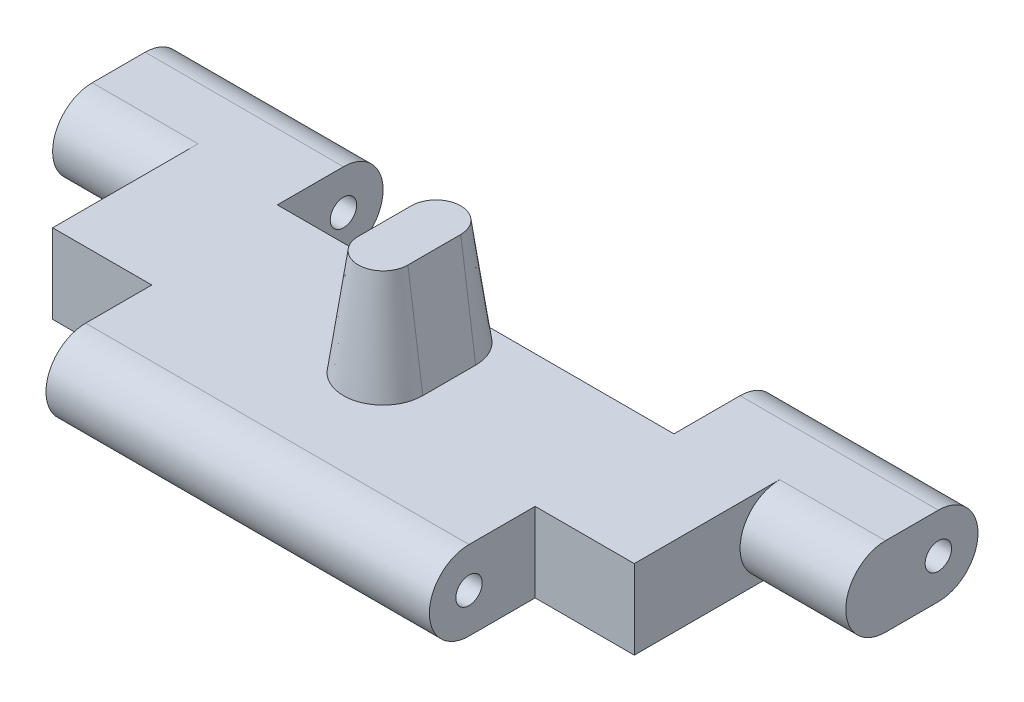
from build123d import *

# Parameters (mm, degrees)
ESQUISSE1_R                  = 0.5
BOSS_EXTRU_1_DEPTH           = 15
ENL_V_MAT_EXTRU_1_DEPTH      = 17.416455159
ENL_V_MAT_EXTRU_1_DEPTH_BACK = 17.416455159
ESQUISSE2_W                  = 15
ESQUISSE2_H                  = 4
ESQUISSE2_W_2                = 7.75
ENL_V_MAT_EXTRU_2_DEPTH      = 4
BOSS_EXTRU_2_DEPTH           = 4
BOSS_EXTRU_2_TAPER           = 8


with BuildPart() as part:
    # Esquisse1 → Boss.-Extru.1 (new, symmetric)
    with BuildSketch(Plane(origin=(0, 0, 0), x_dir=(0, 0, -1), z_dir=(1, 0, 0))):
        with BuildLine():
            Line((-5, 1.5), (5, 1.5))
            ThreePointArc((5, 1.5), (6.5, 0), (5, -1.5))
            Line((5, -1.5), (-5, -1.5))
            ThreePointArc((-5, -1.5), (-6.5, 0), (-5, 1.5))
        make_face()
        with Locations((-5, 0)):
            Circle(ESQUISSE1_R, mode=Mode.SUBTRACT)
        with Locations((5, 0)):
            Circle(ESQUISSE1_R, mode=Mode.SUBTRACT)
    extrude(amount=BOSS_EXTRU_1_DEPTH, both=True)

    # Esquisse2 → Enl_v. mat.-Extru.1 (cut, two sides: drawn at the far end of the back side and taken through both)
    with BuildSketch(Plane(origin=(0, 0, 0), x_dir=(1, 0, 0), z_dir=(0, 1, 0)).offset(-ENL_V_MAT_EXTRU_1_DEPTH_BACK)):
        with Locations((0, 4.5)):
            Rectangle(ESQUISSE2_W, ESQUISSE2_H)
        with Locations((-11.125, -4.5)):
            Rectangle(ESQUISSE2_W_2, ESQUISSE2_H)
        with Locations((11.125, -4.5)):
            Rectangle(ESQUISSE2_W_2, ESQUISSE2_H)
    extrude(amount=ENL_V_MAT_EXTRU_1_DEPTH + ENL_V_MAT_EXTRU_1_DEPTH_BACK, mode=Mode.SUBTRACT)

    # Esquisse3 → Enl_v. mat.-Extru.2 (cut)
    with BuildSketch(Plane.ZY.offset(15)):
        with BuildLine():
            Line((-3, 1.5), (2.5, 1.5))
            Line((2.5, 1.5), (2.5, -1.5))
            Line((2.5, -1.5), (-3, -1.5))
            ThreePointArc((-3, -1.5), (-1.5, 0), (-3, 1.5))
        make_face()
    enl_v_mat_extru_2 = extrude(amount=-ENL_V_MAT_EXTRU_2_DEPTH, mode=Mode.SUBTRACT)

    # Sym_trie1: Enl_v. mat.-Extru.2 across plane
    add(enl_v_mat_extru_2.mirror(Plane(origin=(0, 0, 0), x_dir=(0, 0, 1), z_dir=(1, 0, 0))), mode=Mode.SUBTRACT)

    # Esquisse4 → Boss.-Extru.2 (add)
    with BuildSketch(Plane(origin=(0, 1.5, 0), x_dir=(1, 0, 0), z_dir=(0, 1, 0))):
        with BuildLine():
            ThreePointArc((1.5, 1), (0, 2.5), (-1.5, 1))
            Line((-1.5, 1), (-1.5, -1))
            ThreePointArc((-1.5, -1), (0, -2.5), (1.5, -1))
            Line((1.5, -1), (1.5, 1))
        make_face()
    extrude(amount=BOSS_EXTRU_2_DEPTH, taper=BOSS_EXTRU_2_TAPER)


solid = part.part
